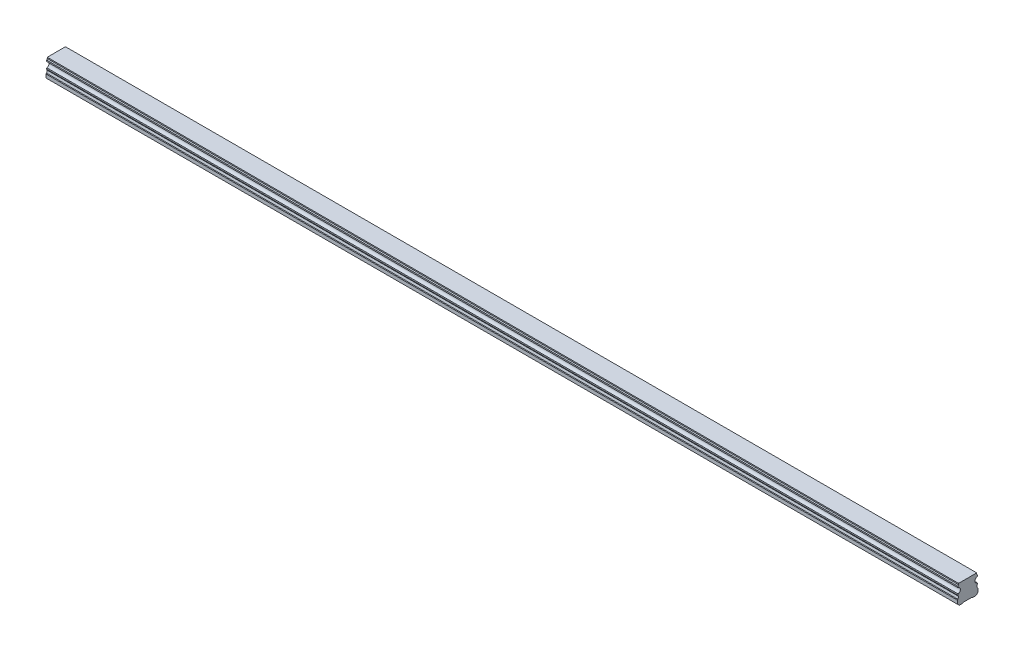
from build123d import *

# Parameters (mm, degrees)
BOSS_EXTRUDE1_DEPTH        = 660
SKETCH3_R                  = 2.5
SKETCH3_R_2                = 2.1
CUT_EXTRUDE3_DEPTH         = 7
SKETCH3_2_R                = 2.1
CUT_EXTRUDE4_DEPTH         = 9.5
CHAMFER1_SIZE              = 0.4
LPATTERN2_COUNT            = 11
LPATTERN2_PITCH            = 60
CHAMFER1_OF_LPATTERN2_SIZE = 0.4


with BuildPart() as part:
    # Sketch1 → Boss-Extrude1 (new body)
    with BuildSketch(Plane(origin=(0, 0, 0), x_dir=(0, 0, -1), z_dir=(1, 0, 0))):
        with BuildLine():
            Line((6.59, 14), (-6.59, 14))
            Line((-6.59, 14), (-6.59, 13.15))
            Line((-6.59, 13.15), (-6.96, 12.356532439))
            Line((-6.96, 12.356532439), (-6.96, 11.435174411))
            ThreePointArc((-6.96, 11.435174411), (-5.25, 9.5), (-6.96, 7.564825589))
            Line((-6.96, 7.564825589), (-6.96, 6.643467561))
            Line((-6.96, 6.643467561), (-6.59, 5.85))
            Line((-6.59, 5.85), (-7.032116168, 4.2))
            Line((-7.032116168, 4.2), (-7.5, 3.929867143))
            Line((-7.5, 3.929867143), (-7.5, 1.4))
            Line((-7.5, 1.4), (-6.1, 0))
            Line((-6.1, 0), (-3.65, 0))
            Line((-3.65, 0), (-3.25, 0.4))
            Line((-3.25, 0.4), (3.25, 0.4))
            Line((3.25, 0.4), (3.65, 0))
            Line((3.65, 0), (6.1, 0))
            Line((6.1, 0), (7.5, 1.4))
            Line((7.5, 1.4), (7.5, 3.929867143))
            Line((7.5, 3.929867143), (7.032116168, 4.2))
            Line((7.032116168, 4.2), (6.59, 5.85))
            Line((6.59, 5.85), (6.96, 6.643467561))
            Line((6.96, 6.643467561), (6.96, 7.564825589))
            ThreePointArc((6.96, 7.564825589), (5.25, 9.5), (6.96, 11.435174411))
            Line((6.96, 11.435174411), (6.96, 12.356532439))
            Line((6.96, 12.356532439), (6.59, 13.15))
            Line((6.59, 13.15), (6.59, 14))
        make_face()
    extrude(amount=BOSS_EXTRUDE1_DEPTH)

    # Sketch3 → Cut-Extrude3 (cut)
    with BuildSketch(Plane.XZ):
        with Locations(Location((30, 0, 0), (0, 0, 270))):
            Circle(SKETCH3_R)
        with Locations(Location((30, 0, 0), (0, 0, 270))):
            Circle(SKETCH3_R_2, mode=Mode.SUBTRACT)
    cut_extrude3 = extrude(amount=-CUT_EXTRUDE3_DEPTH, mode=Mode.SUBTRACT)

    # Sketch3_2 → Cut-Extrude4 (cut)
    with BuildSketch(Plane.XZ):
        with Locations(Location((30, 0, 0), (0, 0, 270))):
            Circle(SKETCH3_2_R)
    cut_extrude4 = extrude(amount=-CUT_EXTRUDE4_DEPTH, mode=Mode.SUBTRACT)

    # Cut-Extrude5 cone 1 section (on through the dimple's axis) → Cut-Extrude5 (revolve, cut)
    with BuildSketch(Plane(origin=(30, 9.5, 0), x_dir=(0, 0, -1), z_dir=(1, 0, 0))):
        Polygon((0, 0), (2.1, 0), (0, 1.212435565), align=None)
    revolve(axis=Axis((30, 9.5, 0), (0, 1, 0)), mode=Mode.SUBTRACT)

    # Chamfer1
    chamfer1_edges = [part.edges().sort_by_distance(p)[0] for p in [
        (30, 0.4, 2.5),
    ]]
    chamfer(chamfer1_edges, length=CHAMFER1_SIZE)

    # LPattern2: Cut-Extrude3, Cut-Extrude4 ×11
    with Locations(*[(i * LPATTERN2_PITCH, 0, 0) for i in range(1, LPATTERN2_COUNT)]):
        add(cut_extrude3, mode=Mode.SUBTRACT)
        add(cut_extrude4, mode=Mode.SUBTRACT)

    # Chamfer1 of LPattern2
    chamfer1_of_lpattern2_edges = [part.edges().sort_by_distance(p)[0] for p in [
        (90, 0.4, 2.5),
        (150, 0.4, 2.5),
        (210, 0.4, 2.5),
        (270, 0.4, 2.5),
        (330, 0.4, 2.5),
        (390, 0.4, 2.5),
        (450, 0.4, 2.5),
        (510, 0.4, 2.5),
        (570, 0.4, 2.5),
        (630, 0.4, 2.5),
    ]]
    chamfer(chamfer1_of_lpattern2_edges, length=CHAMFER1_OF_LPATTERN2_SIZE)


solid = part.part
